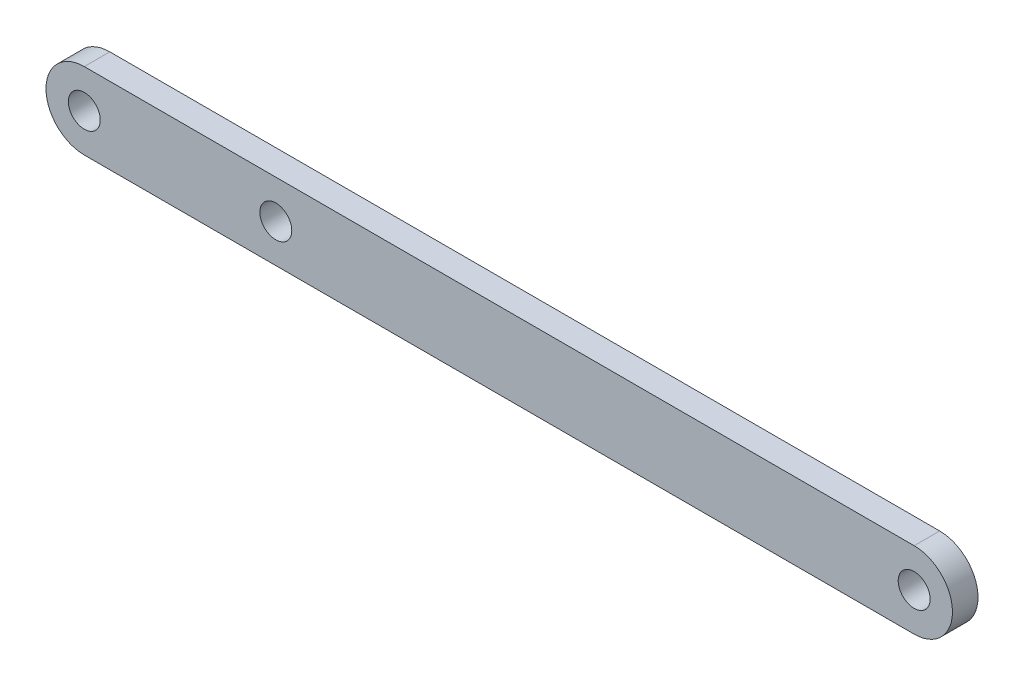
from build123d import *

# Parameters (mm, degrees)
SKETCH_1_R      = 2.5
EXTRUDE_1_DEPTH = 4


with BuildPart() as part:
    # Sketch 1 → Extrude 1 (new body)
    with BuildSketch(Plane.XY):
        with BuildLine():
            Line((-80, 6), (-50, 6))
            Line((-50, 6), (50, 6))
            ThreePointArc((50, 6), (56, 0), (50, -6))
            Line((50, -6), (-50, -6))
            Line((-50, -6), (-80, -6))
            ThreePointArc((-80, -6), (-86, 0), (-80, 6))
        make_face()
        with Locations((-50, 0)):
            Circle(SKETCH_1_R, mode=Mode.SUBTRACT)
        with Locations((50, 0)):
            Circle(SKETCH_1_R, mode=Mode.SUBTRACT)
        with Locations((-80, 0)):
            Circle(SKETCH_1_R, mode=Mode.SUBTRACT)
    extrude(amount=EXTRUDE_1_DEPTH)


solid = part.part
